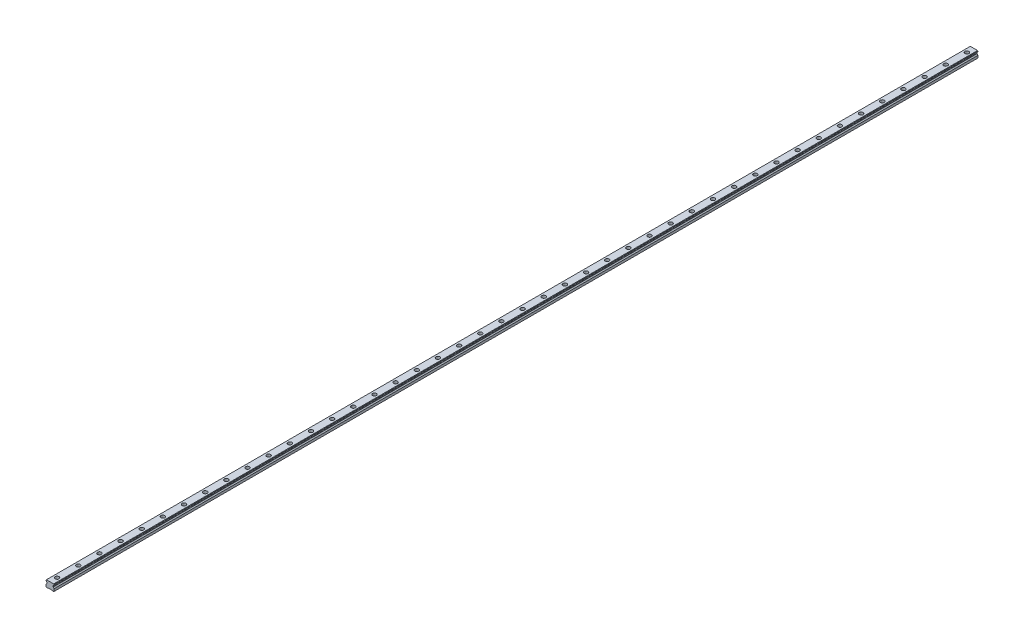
from build123d import *

# Parameters (mm, degrees)
SKETCH1_W           = 23
SKETCH1_H           = 19.2
BOSS_EXTRUDE1_DEPTH = 1310
CUT_EXTRUDE1_DEPTH  = 2621.095587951
CHAMFER1_SIZE       = 1.25
FILLET1_R           = 1.25
CUT_EXTRUDE2_DEPTH  = 2621.095587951
SKETCH4_R           = 5.5
SKETCH4_R_2         = 3.5
CUT_EXTRUDE3_DEPTH  = 9
SKETCH4_2_R         = 3.5
CUT_EXTRUDE4_DEPTH  = 1311.191165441
LPATTERN1_COUNT     = 44
LPATTERN1_PITCH     = 60


with BuildPart() as part:
    # Sketch1 → Boss-Extrude1 (new, symmetric)
    with BuildSketch(Plane.XY):
        with Locations((0, 9.6)):
            Rectangle(SKETCH1_W, SKETCH1_H)
    extrude(amount=BOSS_EXTRUDE1_DEPTH, both=True)

    # Sketch2 → Cut-Extrude1 (cut, through all)
    with BuildSketch(Plane.XY.offset(1310)):
        Polygon((-11.5, 16.7), (-11.5, 7.95), (-8.583333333, 10.866666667), (-8.583333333, 13.783333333), align=None)
        Polygon((8.583333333, 13.783333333), (11.5, 16.7), (11.5, 7.95), (8.583333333, 10.866666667), align=None)
    extrude(amount=-CUT_EXTRUDE1_DEPTH, mode=Mode.SUBTRACT)

    # Chamfer1
    chamfer1_edges = [part.edges().sort_by_distance(p)[0] for p in [
        (-11.5, 19.2, 0),
        (11.5, 19.2, 0),
        (11.5, 0, 0),
        (-11.5, 0, 0),
    ]]
    chamfer(chamfer1_edges, length=CHAMFER1_SIZE)

    # Fillet1
    fillet1_edges = [part.edges().sort_by_distance(p)[0] for p in [
        (-8.583333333, 13.783333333, 0),
        (-8.583333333, 10.866666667, 0),
        (8.583333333, 10.866666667, 0),
        (8.583333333, 13.783333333, 0),
    ]]
    fillet(fillet1_edges, radius=FILLET1_R)

    # Sketch3 → Cut-Extrude2 (cut, through all)
    with BuildSketch(Plane.XY.offset(1310)):
        Polygon((-7, 0), (-5.75, 1.25), (5.75, 1.25), (7, 0), align=None)
    extrude(amount=-CUT_EXTRUDE2_DEPTH, mode=Mode.SUBTRACT)

    # Sketch4 → Cut-Extrude3 (cut)
    with BuildSketch(Plane(origin=(0, 19.2, 0), x_dir=(1, 0, 0), z_dir=(0, 1, 0))):
        with Locations(Location((0, -1290, 0), (0, 0, 270))):
            Circle(SKETCH4_R)
        with Locations(Location((0, -1290, 0), (0, 0, 270))):
            Circle(SKETCH4_R_2, mode=Mode.SUBTRACT)
    cut_extrude3 = extrude(amount=-CUT_EXTRUDE3_DEPTH, mode=Mode.SUBTRACT)

    # Sketch4_2 → Cut-Extrude4 (cut, through all)
    with BuildSketch(Plane(origin=(0, 19.2, 0), x_dir=(1, 0, 0), z_dir=(0, 1, 0))):
        with Locations(Location((0, -1290, 0), (0, 0, 270))):
            Circle(SKETCH4_2_R)
    cut_extrude4 = extrude(amount=-CUT_EXTRUDE4_DEPTH, mode=Mode.SUBTRACT)

    # LPattern1: Cut-Extrude3, Cut-Extrude4 ×44
    with Locations(*[(0, 0, -i * LPATTERN1_PITCH) for i in range(1, LPATTERN1_COUNT)]):
        add(cut_extrude3, mode=Mode.SUBTRACT)
        add(cut_extrude4, mode=Mode.SUBTRACT)


solid = part.part
